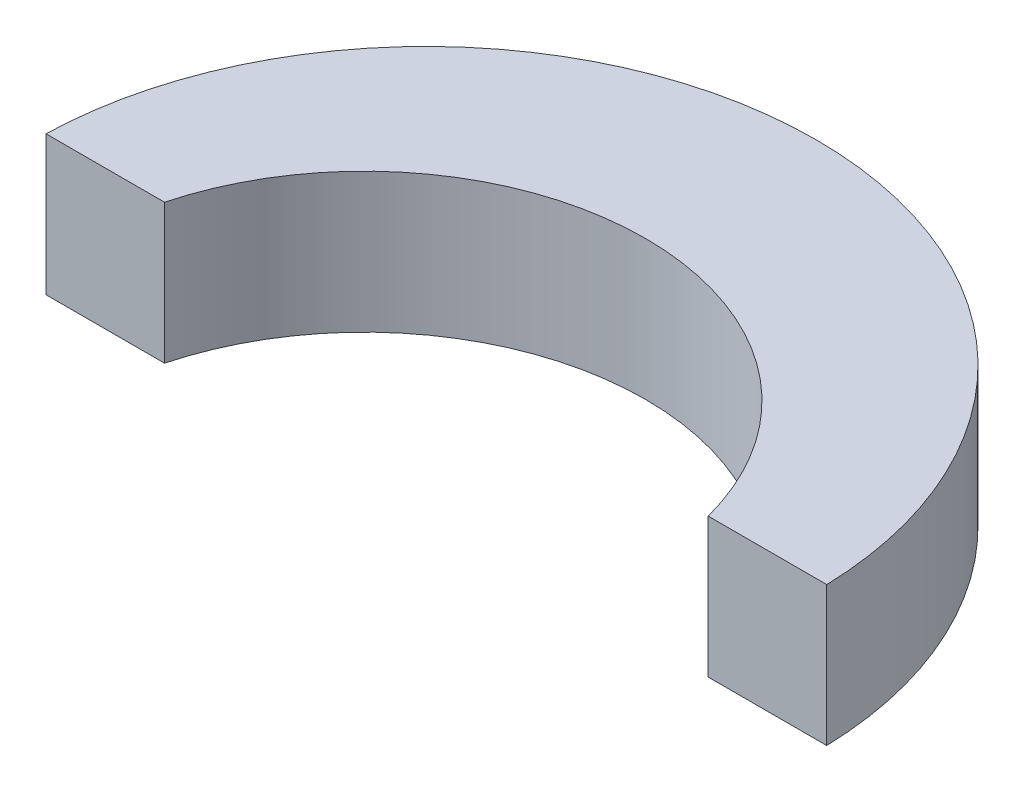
ISO-10303-21;
HEADER;
FILE_DESCRIPTION(('STEP AP214'),'2;1');
FILE_NAME('part.step','',(''),(''),'','','');
FILE_SCHEMA(('AUTOMOTIVE_DESIGN { 1 0 10303 214 1 1 1 1 }'));
ENDSEC;
DATA;
#1=APPLICATION_CONTEXT('core data for automotive mechanical design processes');
#2=APPLICATION_PROTOCOL_DEFINITION('international standard','automotive_design',2000,#1);
#3=PRODUCT_CONTEXT('',#1,'mechanical');
#4=PRODUCT('Part','Part','',(#3));
#5=PRODUCT_RELATED_PRODUCT_CATEGORY('part','',(#4));
#6=PRODUCT_DEFINITION_FORMATION('','',#4);
#7=PRODUCT_DEFINITION_CONTEXT('part definition',#1,'design');
#8=PRODUCT_DEFINITION('design','',#6,#7);
#9=PRODUCT_DEFINITION_SHAPE('','',#8);
#10=(LENGTH_UNIT() NAMED_UNIT(*) SI_UNIT(.MILLI.,.METRE.));
#11=(NAMED_UNIT(*) PLANE_ANGLE_UNIT() SI_UNIT($,.RADIAN.));
#12=(NAMED_UNIT(*) SI_UNIT($,.STERADIAN.) SOLID_ANGLE_UNIT());
#13=UNCERTAINTY_MEASURE_WITH_UNIT(LENGTH_MEASURE(1.E-05),#10,'distance_accuracy_value','');
#14=(GEOMETRIC_REPRESENTATION_CONTEXT(3) GLOBAL_UNCERTAINTY_ASSIGNED_CONTEXT((#13)) GLOBAL_UNIT_ASSIGNED_CONTEXT((#10,
#11,#12)) REPRESENTATION_CONTEXT('',''));
#15=CARTESIAN_POINT('',(0.,0.,0.));
#16=DIRECTION('',(0.,0.,1.));
#17=DIRECTION('',(1.,0.,0.));
#18=AXIS2_PLACEMENT_3D('',#15,#16,#17);
#19=CARTESIAN_POINT('',(-56.,10.,0.));
#20=DIRECTION('',(0.,0.,-1.));
#21=DIRECTION('',(-1.,0.,0.));
#22=AXIS2_PLACEMENT_3D('',#19,#20,#21);
#23=PLANE('',#22);
#24=DIRECTION('',(1.,0.,0.));
#25=VECTOR('',#24,1.);
#26=CARTESIAN_POINT('',(-56.,-10.,0.));
#27=LINE('',#26,#25);
#28=CARTESIAN_POINT('',(-56.,-10.,0.));
#29=VERTEX_POINT('',#28);
#30=CARTESIAN_POINT('',(-39.,-10.,0.));
#31=VERTEX_POINT('',#30);
#32=EDGE_CURVE('E87',#29,#31,#27,.T.);
#33=ORIENTED_EDGE('',*,*,#32,.T.);
#34=DIRECTION('',(0.,-1.,0.));
#35=VECTOR('',#34,1.);
#36=CARTESIAN_POINT('',(-39.,10.,0.));
#37=LINE('',#36,#35);
#38=CARTESIAN_POINT('',(-39.,10.,0.));
#39=VERTEX_POINT('',#38);
#40=EDGE_CURVE('E41',#39,#31,#37,.T.);
#41=ORIENTED_EDGE('',*,*,#40,.F.);
#42=DIRECTION('',(1.,0.,0.));
#43=VECTOR('',#42,1.);
#44=CARTESIAN_POINT('',(-56.,10.,0.));
#45=LINE('',#44,#43);
#46=CARTESIAN_POINT('',(-56.,10.,0.));
#47=VERTEX_POINT('',#46);
#48=EDGE_CURVE('E79',#47,#39,#45,.T.);
#49=ORIENTED_EDGE('',*,*,#48,.F.);
#50=DIRECTION('',(0.,-1.,0.));
#51=VECTOR('',#50,1.);
#52=CARTESIAN_POINT('',(-56.,10.,0.));
#53=LINE('',#52,#51);
#54=EDGE_CURVE('E11',#47,#29,#53,.T.);
#55=ORIENTED_EDGE('',*,*,#54,.T.);
#56=EDGE_LOOP('',(#33,#41,#49,#55));
#57=FACE_BOUND('',#56,.T.);
#58=ADVANCED_FACE('F33',(#57),#23,.F.);
#59=CARTESIAN_POINT('',(0.,10.,10.35));
#60=DIRECTION('',(0.,-1.,0.));
#61=DIRECTION('',(0.,0.,-1.));
#62=AXIS2_PLACEMENT_3D('',#59,#60,#61);
#63=CYLINDRICAL_SURFACE('',#62,40.35);
#64=CARTESIAN_POINT('',(0.,-10.,10.35));
#65=DIRECTION('',(0.,-1.,0.));
#66=DIRECTION('',(0.,0.,-1.));
#67=AXIS2_PLACEMENT_3D('',#64,#65,#66);
#68=CIRCLE('',#67,40.35);
#69=CARTESIAN_POINT('',(39.,-10.,0.));
#70=VERTEX_POINT('',#69);
#71=EDGE_CURVE('E66',#31,#70,#68,.T.);
#72=ORIENTED_EDGE('',*,*,#71,.T.);
#73=DIRECTION('',(0.,-1.,0.));
#74=VECTOR('',#73,1.);
#75=CARTESIAN_POINT('',(39.,10.,0.));
#76=LINE('',#75,#74);
#77=CARTESIAN_POINT('',(39.,10.,0.));
#78=VERTEX_POINT('',#77);
#79=EDGE_CURVE('E88',#78,#70,#76,.T.);
#80=ORIENTED_EDGE('',*,*,#79,.F.);
#81=CARTESIAN_POINT('',(0.,10.,10.35));
#82=DIRECTION('',(0.,-1.,0.));
#83=DIRECTION('',(0.,0.,1.));
#84=AXIS2_PLACEMENT_3D('',#81,#82,#83);
#85=CIRCLE('',#84,40.35);
#86=EDGE_CURVE('E83',#39,#78,#85,.T.);
#87=ORIENTED_EDGE('',*,*,#86,.F.);
#88=ORIENTED_EDGE('',*,*,#40,.T.);
#89=EDGE_LOOP('',(#72,#80,#87,#88));
#90=FACE_BOUND('',#89,.T.);
#91=ADVANCED_FACE('F89',(#90),#63,.F.);
#92=CARTESIAN_POINT('',(39.,10.,0.));
#93=DIRECTION('',(0.,0.,-1.));
#94=DIRECTION('',(-1.,0.,0.));
#95=AXIS2_PLACEMENT_3D('',#92,#93,#94);
#96=PLANE('',#95);
#97=DIRECTION('',(1.,0.,0.));
#98=VECTOR('',#97,1.);
#99=CARTESIAN_POINT('',(39.,-10.,0.));
#100=LINE('',#99,#98);
#101=CARTESIAN_POINT('',(56.,-10.,0.));
#102=VERTEX_POINT('',#101);
#103=EDGE_CURVE('E73',#70,#102,#100,.T.);
#104=ORIENTED_EDGE('',*,*,#103,.T.);
#105=DIRECTION('',(0.,-1.,0.));
#106=VECTOR('',#105,1.);
#107=CARTESIAN_POINT('',(56.,10.,0.));
#108=LINE('',#107,#106);
#109=CARTESIAN_POINT('',(56.,10.,0.));
#110=VERTEX_POINT('',#109);
#111=EDGE_CURVE('E93',#110,#102,#108,.T.);
#112=ORIENTED_EDGE('',*,*,#111,.F.);
#113=DIRECTION('',(1.,0.,0.));
#114=VECTOR('',#113,1.);
#115=CARTESIAN_POINT('',(39.,10.,0.));
#116=LINE('',#115,#114);
#117=EDGE_CURVE('E91',#78,#110,#116,.T.);
#118=ORIENTED_EDGE('',*,*,#117,.F.);
#119=ORIENTED_EDGE('',*,*,#79,.T.);
#120=EDGE_LOOP('',(#104,#112,#118,#119));
#121=FACE_BOUND('',#120,.T.);
#122=ADVANCED_FACE('F103',(#121),#96,.F.);
#123=CARTESIAN_POINT('',(0.,10.,1.52064220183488));
#124=DIRECTION('',(0.,-1.,0.));
#125=DIRECTION('',(0.,0.,-1.));
#126=AXIS2_PLACEMENT_3D('',#123,#124,#125);
#127=CYLINDRICAL_SURFACE('',#126,56.0206422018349);
#128=CARTESIAN_POINT('',(0.,-10.,1.52064220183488));
#129=DIRECTION('',(0.,1.,0.));
#130=DIRECTION('',(0.,0.,-1.));
#131=AXIS2_PLACEMENT_3D('',#128,#129,#130);
#132=CIRCLE('',#131,56.0206422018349);
#133=EDGE_CURVE('E100',#102,#29,#132,.T.);
#134=ORIENTED_EDGE('',*,*,#133,.T.);
#135=ORIENTED_EDGE('',*,*,#54,.F.);
#136=CARTESIAN_POINT('',(0.,10.,1.52064220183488));
#137=DIRECTION('',(0.,1.,0.));
#138=DIRECTION('',(0.,0.,1.));
#139=AXIS2_PLACEMENT_3D('',#136,#137,#138);
#140=CIRCLE('',#139,56.0206422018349);
#141=EDGE_CURVE('E49',#110,#47,#140,.T.);
#142=ORIENTED_EDGE('',*,*,#141,.F.);
#143=ORIENTED_EDGE('',*,*,#111,.T.);
#144=EDGE_LOOP('',(#134,#135,#142,#143));
#145=FACE_BOUND('',#144,.T.);
#146=ADVANCED_FACE('F107',(#145),#127,.T.);
#147=CARTESIAN_POINT('',(0.,10.,1.52064220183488));
#148=DIRECTION('',(0.,1.,0.));
#149=DIRECTION('',(0.,0.,1.));
#150=AXIS2_PLACEMENT_3D('',#147,#148,#149);
#151=PLANE('',#150);
#152=ORIENTED_EDGE('',*,*,#141,.T.);
#153=ORIENTED_EDGE('',*,*,#48,.T.);
#154=ORIENTED_EDGE('',*,*,#86,.T.);
#155=ORIENTED_EDGE('',*,*,#117,.T.);
#156=EDGE_LOOP('',(#152,#153,#154,#155));
#157=FACE_BOUND('',#156,.T.);
#158=ADVANCED_FACE('F81',(#157),#151,.T.);
#159=CARTESIAN_POINT('',(0.,-10.,1.52064220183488));
#160=DIRECTION('',(0.,1.,0.));
#161=DIRECTION('',(0.,0.,1.));
#162=AXIS2_PLACEMENT_3D('',#159,#160,#161);
#163=PLANE('',#162);
#164=ORIENTED_EDGE('',*,*,#32,.F.);
#165=ORIENTED_EDGE('',*,*,#133,.F.);
#166=ORIENTED_EDGE('',*,*,#103,.F.);
#167=ORIENTED_EDGE('',*,*,#71,.F.);
#168=EDGE_LOOP('',(#164,#165,#166,#167));
#169=FACE_BOUND('',#168,.T.);
#170=ADVANCED_FACE('F106',(#169),#163,.F.);
#171=CLOSED_SHELL('',(#58,#91,#122,#146,#158,#170));
#172=MANIFOLD_SOLID_BREP('B2',#171);
#173=ADVANCED_BREP_SHAPE_REPRESENTATION('',(#18,#172),#14);
#174=SHAPE_DEFINITION_REPRESENTATION(#9,#173);
ENDSEC;
END-ISO-10303-21;
